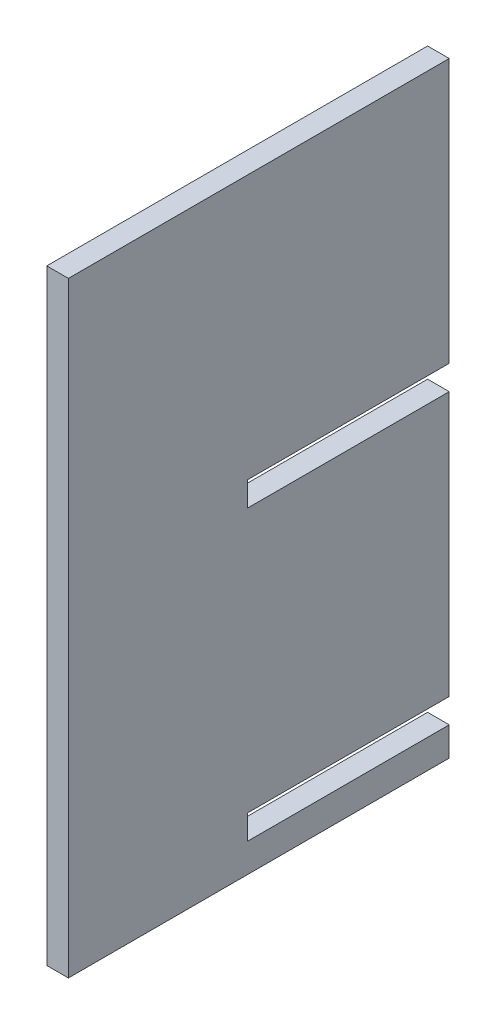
ISO-10303-21;
HEADER;
FILE_DESCRIPTION(('STEP AP214'),'2;1');
FILE_NAME('part.step','',(''),(''),'','','');
FILE_SCHEMA(('AUTOMOTIVE_DESIGN { 1 0 10303 214 1 1 1 1 }'));
ENDSEC;
DATA;
#1=APPLICATION_CONTEXT('core data for automotive mechanical design processes');
#2=APPLICATION_PROTOCOL_DEFINITION('international standard','automotive_design',2000,#1);
#3=PRODUCT_CONTEXT('',#1,'mechanical');
#4=PRODUCT('Part','Part','',(#3));
#5=PRODUCT_RELATED_PRODUCT_CATEGORY('part','',(#4));
#6=PRODUCT_DEFINITION_FORMATION('','',#4);
#7=PRODUCT_DEFINITION_CONTEXT('part definition',#1,'design');
#8=PRODUCT_DEFINITION('design','',#6,#7);
#9=PRODUCT_DEFINITION_SHAPE('','',#8);
#10=(LENGTH_UNIT() NAMED_UNIT(*) SI_UNIT(.MILLI.,.METRE.));
#11=(NAMED_UNIT(*) PLANE_ANGLE_UNIT() SI_UNIT($,.RADIAN.));
#12=(NAMED_UNIT(*) SI_UNIT($,.STERADIAN.) SOLID_ANGLE_UNIT());
#13=UNCERTAINTY_MEASURE_WITH_UNIT(LENGTH_MEASURE(1.E-05),#10,'distance_accuracy_value','');
#14=(GEOMETRIC_REPRESENTATION_CONTEXT(3) GLOBAL_UNCERTAINTY_ASSIGNED_CONTEXT((#13)) GLOBAL_UNIT_ASSIGNED_CONTEXT((#10,
#11,#12)) REPRESENTATION_CONTEXT('',''));
#15=CARTESIAN_POINT('',(0.,0.,0.));
#16=DIRECTION('',(0.,0.,1.));
#17=DIRECTION('',(1.,0.,0.));
#18=AXIS2_PLACEMENT_3D('',#15,#16,#17);
#19=CARTESIAN_POINT('',(0.,0.,0.));
#20=DIRECTION('',(0.,0.,-1.));
#21=DIRECTION('',(-1.,0.,0.));
#22=AXIS2_PLACEMENT_3D('',#19,#20,#21);
#23=PLANE('',#22);
#24=DIRECTION('',(1.,0.,0.));
#25=VECTOR('',#24,1.);
#26=CARTESIAN_POINT('',(-32.352836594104,19.15,0.));
#27=LINE('',#26,#25);
#28=CARTESIAN_POINT('',(-18.25,19.15,0.));
#29=VERTEX_POINT('',#28);
#30=CARTESIAN_POINT('',(-16.75,19.15,0.));
#31=VERTEX_POINT('',#30);
#32=EDGE_CURVE('E135',#29,#31,#27,.T.);
#33=ORIENTED_EDGE('',*,*,#32,.T.);
#34=DIRECTION('',(0.,1.,0.));
#35=VECTOR('',#34,1.);
#36=CARTESIAN_POINT('',(-16.75,-39.75,0.));
#37=LINE('',#36,#35);
#38=CARTESIAN_POINT('',(-16.75,0.849999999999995,0.));
#39=VERTEX_POINT('',#38);
#40=EDGE_CURVE('E132',#39,#31,#37,.T.);
#41=ORIENTED_EDGE('',*,*,#40,.F.);
#42=DIRECTION('',(1.,0.,0.));
#43=VECTOR('',#42,1.);
#44=CARTESIAN_POINT('',(-32.352836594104,0.849999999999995,0.));
#45=LINE('',#44,#43);
#46=CARTESIAN_POINT('',(-18.25,0.849999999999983,0.));
#47=VERTEX_POINT('',#46);
#48=EDGE_CURVE('E170',#47,#39,#45,.T.);
#49=ORIENTED_EDGE('',*,*,#48,.F.);
#50=DIRECTION('',(0.,-1.,0.));
#51=VECTOR('',#50,1.);
#52=CARTESIAN_POINT('',(-18.25,-39.75,0.));
#53=LINE('',#52,#51);
#54=EDGE_CURVE('E58',#29,#47,#53,.T.);
#55=ORIENTED_EDGE('',*,*,#54,.F.);
#56=EDGE_LOOP('',(#33,#41,#49,#55));
#57=FACE_BOUND('',#56,.T.);
#58=ADVANCED_FACE('F33',(#57),#23,.T.);
#59=DIRECTION('',(1.,0.,0.));
#60=VECTOR('',#59,1.);
#61=CARTESIAN_POINT('',(-32.352836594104,-0.850000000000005,0.));
#62=LINE('',#61,#60);
#63=CARTESIAN_POINT('',(-18.25,-0.850000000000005,0.));
#64=VERTEX_POINT('',#63);
#65=CARTESIAN_POINT('',(-16.75,-0.850000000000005,0.));
#66=VERTEX_POINT('',#65);
#67=EDGE_CURVE('E160',#64,#66,#62,.T.);
#68=ORIENTED_EDGE('',*,*,#67,.T.);
#69=CARTESIAN_POINT('',(-16.75,-19.15,0.));
#70=VERTEX_POINT('',#69);
#71=EDGE_CURVE('E206',#70,#66,#37,.T.);
#72=ORIENTED_EDGE('',*,*,#71,.F.);
#73=DIRECTION('',(1.,0.,0.));
#74=VECTOR('',#73,1.);
#75=CARTESIAN_POINT('',(-32.352836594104,-19.15,0.));
#76=LINE('',#75,#74);
#77=CARTESIAN_POINT('',(-18.25,-19.15,0.));
#78=VERTEX_POINT('',#77);
#79=EDGE_CURVE('E194',#78,#70,#76,.T.);
#80=ORIENTED_EDGE('',*,*,#79,.F.);
#81=EDGE_CURVE('E205',#64,#78,#53,.T.);
#82=ORIENTED_EDGE('',*,*,#81,.F.);
#83=EDGE_LOOP('',(#68,#72,#80,#82));
#84=FACE_BOUND('',#83,.T.);
#85=ADVANCED_FACE('F231',(#84),#23,.T.);
#86=DIRECTION('',(1.,0.,0.));
#87=VECTOR('',#86,1.);
#88=CARTESIAN_POINT('',(-51.7361165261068,-22.85,0.));
#89=LINE('',#88,#87);
#90=CARTESIAN_POINT('',(-18.25,-22.85,0.));
#91=VERTEX_POINT('',#90);
#92=CARTESIAN_POINT('',(-16.75,-22.85,0.));
#93=VERTEX_POINT('',#92);
#94=EDGE_CURVE('E148',#91,#93,#89,.T.);
#95=ORIENTED_EDGE('',*,*,#94,.F.);
#96=CARTESIAN_POINT('',(-18.25,-20.85,0.));
#97=VERTEX_POINT('',#96);
#98=EDGE_CURVE('E204',#97,#91,#53,.T.);
#99=ORIENTED_EDGE('',*,*,#98,.F.);
#100=DIRECTION('',(1.,0.,0.));
#101=VECTOR('',#100,1.);
#102=CARTESIAN_POINT('',(-32.352836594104,-20.85,0.));
#103=LINE('',#102,#101);
#104=CARTESIAN_POINT('',(-16.75,-20.85,0.));
#105=VERTEX_POINT('',#104);
#106=EDGE_CURVE('E183',#97,#105,#103,.T.);
#107=ORIENTED_EDGE('',*,*,#106,.T.);
#108=EDGE_CURVE('E37',#93,#105,#37,.T.);
#109=ORIENTED_EDGE('',*,*,#108,.F.);
#110=EDGE_LOOP('',(#95,#99,#107,#109));
#111=FACE_BOUND('',#110,.T.);
#112=ADVANCED_FACE('F213',(#111),#23,.T.);
#113=CARTESIAN_POINT('',(-18.25,-39.75,26.4));
#114=DIRECTION('',(1.,0.,0.));
#115=DIRECTION('',(0.,0.,-1.));
#116=AXIS2_PLACEMENT_3D('',#113,#114,#115);
#117=PLANE('',#116);
#118=DIRECTION('',(0.,-1.,0.));
#119=VECTOR('',#118,1.);
#120=CARTESIAN_POINT('',(-18.25,-39.75,26.4));
#121=LINE('',#120,#119);
#122=CARTESIAN_POINT('',(-18.25,19.15,26.4));
#123=VERTEX_POINT('',#122);
#124=CARTESIAN_POINT('',(-18.25,-22.85,26.4));
#125=VERTEX_POINT('',#124);
#126=EDGE_CURVE('E42',#123,#125,#121,.T.);
#127=ORIENTED_EDGE('',*,*,#126,.F.);
#128=DIRECTION('',(0.,0.,1.));
#129=VECTOR('',#128,1.);
#130=CARTESIAN_POINT('',(-18.25,19.15,0.));
#131=LINE('',#130,#129);
#132=EDGE_CURVE('E141',#29,#123,#131,.T.);
#133=ORIENTED_EDGE('',*,*,#132,.F.);
#134=ORIENTED_EDGE('',*,*,#54,.T.);
#135=DIRECTION('',(0.,0.,-1.));
#136=VECTOR('',#135,1.);
#137=CARTESIAN_POINT('',(-18.25,0.849999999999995,0.));
#138=LINE('',#137,#136);
#139=CARTESIAN_POINT('',(-18.25,0.849999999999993,14.));
#140=VERTEX_POINT('',#139);
#141=EDGE_CURVE('E162',#140,#47,#138,.T.);
#142=ORIENTED_EDGE('',*,*,#141,.F.);
#143=DIRECTION('',(0.,1.,0.));
#144=VECTOR('',#143,1.);
#145=CARTESIAN_POINT('',(-18.25,-0.850000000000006,14.));
#146=LINE('',#145,#144);
#147=CARTESIAN_POINT('',(-18.25,-0.850000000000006,14.));
#148=VERTEX_POINT('',#147);
#149=EDGE_CURVE('E157',#148,#140,#146,.T.);
#150=ORIENTED_EDGE('',*,*,#149,.F.);
#151=DIRECTION('',(0.,0.,1.));
#152=VECTOR('',#151,1.);
#153=CARTESIAN_POINT('',(-18.25,-0.850000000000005,0.));
#154=LINE('',#153,#152);
#155=EDGE_CURVE('E159',#64,#148,#154,.T.);
#156=ORIENTED_EDGE('',*,*,#155,.F.);
#157=ORIENTED_EDGE('',*,*,#81,.T.);
#158=DIRECTION('',(0.,0.,-1.));
#159=VECTOR('',#158,1.);
#160=CARTESIAN_POINT('',(-18.25,-19.15,0.));
#161=LINE('',#160,#159);
#162=CARTESIAN_POINT('',(-18.25,-19.15,14.));
#163=VERTEX_POINT('',#162);
#164=EDGE_CURVE('E185',#163,#78,#161,.T.);
#165=ORIENTED_EDGE('',*,*,#164,.F.);
#166=DIRECTION('',(0.,1.,0.));
#167=VECTOR('',#166,1.);
#168=CARTESIAN_POINT('',(-18.25,-20.85,14.));
#169=LINE('',#168,#167);
#170=CARTESIAN_POINT('',(-18.25,-20.85,14.));
#171=VERTEX_POINT('',#170);
#172=EDGE_CURVE('E180',#171,#163,#169,.T.);
#173=ORIENTED_EDGE('',*,*,#172,.F.);
#174=DIRECTION('',(0.,0.,1.));
#175=VECTOR('',#174,1.);
#176=CARTESIAN_POINT('',(-18.25,-20.85,0.));
#177=LINE('',#176,#175);
#178=EDGE_CURVE('E182',#97,#171,#177,.T.);
#179=ORIENTED_EDGE('',*,*,#178,.F.);
#180=ORIENTED_EDGE('',*,*,#98,.T.);
#181=DIRECTION('',(0.,0.,-1.));
#182=VECTOR('',#181,1.);
#183=CARTESIAN_POINT('',(-18.25,-22.85,0.));
#184=LINE('',#183,#182);
#185=EDGE_CURVE('E136',#125,#91,#184,.T.);
#186=ORIENTED_EDGE('',*,*,#185,.F.);
#187=EDGE_LOOP('',(#127,#133,#134,#142,#150,#156,#157,#165,#173,#179,#180,#186));
#188=FACE_BOUND('',#187,.T.);
#189=ADVANCED_FACE('F35',(#188),#117,.F.);
#190=CARTESIAN_POINT('',(-16.75,-39.75,26.4));
#191=DIRECTION('',(-1.,0.,0.));
#192=DIRECTION('',(0.,0.,1.));
#193=AXIS2_PLACEMENT_3D('',#190,#191,#192);
#194=PLANE('',#193);
#195=DIRECTION('',(0.,0.,-1.));
#196=VECTOR('',#195,1.);
#197=CARTESIAN_POINT('',(-16.75,19.15,0.));
#198=LINE('',#197,#196);
#199=CARTESIAN_POINT('',(-16.75,19.15,26.4));
#200=VERTEX_POINT('',#199);
#201=EDGE_CURVE('E127',#200,#31,#198,.T.);
#202=ORIENTED_EDGE('',*,*,#201,.F.);
#203=DIRECTION('',(0.,1.,0.));
#204=VECTOR('',#203,1.);
#205=CARTESIAN_POINT('',(-16.75,-39.75,26.4));
#206=LINE('',#205,#204);
#207=CARTESIAN_POINT('',(-16.75,-22.85,26.4));
#208=VERTEX_POINT('',#207);
#209=EDGE_CURVE('E11',#208,#200,#206,.T.);
#210=ORIENTED_EDGE('',*,*,#209,.F.);
#211=DIRECTION('',(0.,0.,1.));
#212=VECTOR('',#211,1.);
#213=CARTESIAN_POINT('',(-16.75,-22.85,0.));
#214=LINE('',#213,#212);
#215=EDGE_CURVE('E50',#93,#208,#214,.T.);
#216=ORIENTED_EDGE('',*,*,#215,.F.);
#217=ORIENTED_EDGE('',*,*,#108,.T.);
#218=DIRECTION('',(0.,0.,-1.));
#219=VECTOR('',#218,1.);
#220=CARTESIAN_POINT('',(-16.75,-20.85,0.));
#221=LINE('',#220,#219);
#222=CARTESIAN_POINT('',(-16.75,-20.85,14.));
#223=VERTEX_POINT('',#222);
#224=EDGE_CURVE('E191',#223,#105,#221,.T.);
#225=ORIENTED_EDGE('',*,*,#224,.F.);
#226=DIRECTION('',(0.,-1.,0.));
#227=VECTOR('',#226,1.);
#228=CARTESIAN_POINT('',(-16.75,-20.85,14.));
#229=LINE('',#228,#227);
#230=CARTESIAN_POINT('',(-16.75,-19.15,14.));
#231=VERTEX_POINT('',#230);
#232=EDGE_CURVE('E188',#231,#223,#229,.T.);
#233=ORIENTED_EDGE('',*,*,#232,.F.);
#234=DIRECTION('',(0.,0.,1.));
#235=VECTOR('',#234,1.);
#236=CARTESIAN_POINT('',(-16.75,-19.15,0.));
#237=LINE('',#236,#235);
#238=EDGE_CURVE('E179',#70,#231,#237,.T.);
#239=ORIENTED_EDGE('',*,*,#238,.F.);
#240=ORIENTED_EDGE('',*,*,#71,.T.);
#241=DIRECTION('',(0.,0.,-1.));
#242=VECTOR('',#241,1.);
#243=CARTESIAN_POINT('',(-16.75,-0.850000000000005,0.));
#244=LINE('',#243,#242);
#245=CARTESIAN_POINT('',(-16.75,-0.850000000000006,14.));
#246=VERTEX_POINT('',#245);
#247=EDGE_CURVE('E168',#246,#66,#244,.T.);
#248=ORIENTED_EDGE('',*,*,#247,.F.);
#249=DIRECTION('',(0.,-1.,0.));
#250=VECTOR('',#249,1.);
#251=CARTESIAN_POINT('',(-16.75,-0.850000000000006,14.));
#252=LINE('',#251,#250);
#253=CARTESIAN_POINT('',(-16.75,0.849999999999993,14.));
#254=VERTEX_POINT('',#253);
#255=EDGE_CURVE('E165',#254,#246,#252,.T.);
#256=ORIENTED_EDGE('',*,*,#255,.F.);
#257=DIRECTION('',(0.,0.,1.));
#258=VECTOR('',#257,1.);
#259=CARTESIAN_POINT('',(-16.75,0.849999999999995,0.));
#260=LINE('',#259,#258);
#261=EDGE_CURVE('E154',#39,#254,#260,.T.);
#262=ORIENTED_EDGE('',*,*,#261,.F.);
#263=ORIENTED_EDGE('',*,*,#40,.T.);
#264=EDGE_LOOP('',(#202,#210,#216,#217,#225,#233,#239,#240,#248,#256,#262,#263));
#265=FACE_BOUND('',#264,.T.);
#266=ADVANCED_FACE('F129',(#265),#194,.F.);
#267=CARTESIAN_POINT('',(0.,0.,26.4));
#268=DIRECTION('',(0.,0.,-1.));
#269=DIRECTION('',(-1.,0.,0.));
#270=AXIS2_PLACEMENT_3D('',#267,#268,#269);
#271=PLANE('',#270);
#272=ORIENTED_EDGE('',*,*,#209,.T.);
#273=DIRECTION('',(1.,0.,0.));
#274=VECTOR('',#273,1.);
#275=CARTESIAN_POINT('',(-51.7361165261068,19.15,26.4));
#276=LINE('',#275,#274);
#277=EDGE_CURVE('E139',#123,#200,#276,.T.);
#278=ORIENTED_EDGE('',*,*,#277,.F.);
#279=ORIENTED_EDGE('',*,*,#126,.T.);
#280=DIRECTION('',(1.,0.,0.));
#281=VECTOR('',#280,1.);
#282=CARTESIAN_POINT('',(-51.7361165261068,-22.85,26.4));
#283=LINE('',#282,#281);
#284=EDGE_CURVE('E146',#125,#208,#283,.T.);
#285=ORIENTED_EDGE('',*,*,#284,.T.);
#286=EDGE_LOOP('',(#272,#278,#279,#285));
#287=FACE_BOUND('',#286,.T.);
#288=ADVANCED_FACE('F145',(#287),#271,.F.);
#289=CARTESIAN_POINT('',(-32.352836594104,-20.85,0.));
#290=DIRECTION('',(0.,-1.,0.));
#291=DIRECTION('',(0.,0.,-1.));
#292=AXIS2_PLACEMENT_3D('',#289,#290,#291);
#293=PLANE('',#292);
#294=ORIENTED_EDGE('',*,*,#178,.T.);
#295=DIRECTION('',(1.,0.,0.));
#296=VECTOR('',#295,1.);
#297=CARTESIAN_POINT('',(-32.352836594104,-20.85,14.));
#298=LINE('',#297,#296);
#299=EDGE_CURVE('E197',#171,#223,#298,.T.);
#300=ORIENTED_EDGE('',*,*,#299,.T.);
#301=ORIENTED_EDGE('',*,*,#224,.T.);
#302=ORIENTED_EDGE('',*,*,#106,.F.);
#303=EDGE_LOOP('',(#294,#300,#301,#302));
#304=FACE_BOUND('',#303,.T.);
#305=ADVANCED_FACE('F219',(#304),#293,.F.);
#306=CARTESIAN_POINT('',(-32.352836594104,-20.85,14.));
#307=DIRECTION('',(0.,0.,1.));
#308=DIRECTION('',(1.,0.,0.));
#309=AXIS2_PLACEMENT_3D('',#306,#307,#308);
#310=PLANE('',#309);
#311=ORIENTED_EDGE('',*,*,#172,.T.);
#312=DIRECTION('',(1.,0.,0.));
#313=VECTOR('',#312,1.);
#314=CARTESIAN_POINT('',(-32.352836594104,-19.15,14.));
#315=LINE('',#314,#313);
#316=EDGE_CURVE('E199',#163,#231,#315,.T.);
#317=ORIENTED_EDGE('',*,*,#316,.T.);
#318=ORIENTED_EDGE('',*,*,#232,.T.);
#319=ORIENTED_EDGE('',*,*,#299,.F.);
#320=EDGE_LOOP('',(#311,#317,#318,#319));
#321=FACE_BOUND('',#320,.T.);
#322=ADVANCED_FACE('F222',(#321),#310,.F.);
#323=CARTESIAN_POINT('',(-32.352836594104,-19.15,0.));
#324=DIRECTION('',(0.,1.,0.));
#325=DIRECTION('',(0.,0.,1.));
#326=AXIS2_PLACEMENT_3D('',#323,#324,#325);
#327=PLANE('',#326);
#328=ORIENTED_EDGE('',*,*,#164,.T.);
#329=ORIENTED_EDGE('',*,*,#79,.T.);
#330=ORIENTED_EDGE('',*,*,#238,.T.);
#331=ORIENTED_EDGE('',*,*,#316,.F.);
#332=EDGE_LOOP('',(#328,#329,#330,#331));
#333=FACE_BOUND('',#332,.T.);
#334=ADVANCED_FACE('F268',(#333),#327,.F.);
#335=CARTESIAN_POINT('',(-32.352836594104,-0.850000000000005,0.));
#336=DIRECTION('',(0.,-1.,0.));
#337=DIRECTION('',(0.,0.,-1.));
#338=AXIS2_PLACEMENT_3D('',#335,#336,#337);
#339=PLANE('',#338);
#340=ORIENTED_EDGE('',*,*,#155,.T.);
#341=DIRECTION('',(1.,0.,0.));
#342=VECTOR('',#341,1.);
#343=CARTESIAN_POINT('',(-32.352836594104,-0.850000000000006,14.));
#344=LINE('',#343,#342);
#345=EDGE_CURVE('E173',#148,#246,#344,.T.);
#346=ORIENTED_EDGE('',*,*,#345,.T.);
#347=ORIENTED_EDGE('',*,*,#247,.T.);
#348=ORIENTED_EDGE('',*,*,#67,.F.);
#349=EDGE_LOOP('',(#340,#346,#347,#348));
#350=FACE_BOUND('',#349,.T.);
#351=ADVANCED_FACE('F235',(#350),#339,.F.);
#352=CARTESIAN_POINT('',(-32.352836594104,-0.850000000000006,14.));
#353=DIRECTION('',(0.,0.,1.));
#354=DIRECTION('',(1.,0.,0.));
#355=AXIS2_PLACEMENT_3D('',#352,#353,#354);
#356=PLANE('',#355);
#357=ORIENTED_EDGE('',*,*,#149,.T.);
#358=DIRECTION('',(1.,0.,0.));
#359=VECTOR('',#358,1.);
#360=CARTESIAN_POINT('',(-32.352836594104,0.849999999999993,14.));
#361=LINE('',#360,#359);
#362=EDGE_CURVE('E175',#140,#254,#361,.T.);
#363=ORIENTED_EDGE('',*,*,#362,.T.);
#364=ORIENTED_EDGE('',*,*,#255,.T.);
#365=ORIENTED_EDGE('',*,*,#345,.F.);
#366=EDGE_LOOP('',(#357,#363,#364,#365));
#367=FACE_BOUND('',#366,.T.);
#368=ADVANCED_FACE('F241',(#367),#356,.F.);
#369=CARTESIAN_POINT('',(-32.352836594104,0.849999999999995,0.));
#370=DIRECTION('',(0.,1.,0.));
#371=DIRECTION('',(0.,0.,1.));
#372=AXIS2_PLACEMENT_3D('',#369,#370,#371);
#373=PLANE('',#372);
#374=ORIENTED_EDGE('',*,*,#141,.T.);
#375=ORIENTED_EDGE('',*,*,#48,.T.);
#376=ORIENTED_EDGE('',*,*,#261,.T.);
#377=ORIENTED_EDGE('',*,*,#362,.F.);
#378=EDGE_LOOP('',(#374,#375,#376,#377));
#379=FACE_BOUND('',#378,.T.);
#380=ADVANCED_FACE('F243',(#379),#373,.F.);
#381=CARTESIAN_POINT('',(-32.352836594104,19.15,0.));
#382=DIRECTION('',(0.,-1.,0.));
#383=DIRECTION('',(0.,0.,-1.));
#384=AXIS2_PLACEMENT_3D('',#381,#382,#383);
#385=PLANE('',#384);
#386=ORIENTED_EDGE('',*,*,#132,.T.);
#387=ORIENTED_EDGE('',*,*,#277,.T.);
#388=ORIENTED_EDGE('',*,*,#201,.T.);
#389=ORIENTED_EDGE('',*,*,#32,.F.);
#390=EDGE_LOOP('',(#386,#387,#388,#389));
#391=FACE_BOUND('',#390,.T.);
#392=ADVANCED_FACE('F140',(#391),#385,.F.);
#393=CARTESIAN_POINT('',(-51.7361165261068,-22.85,0.));
#394=DIRECTION('',(0.,1.,0.));
#395=DIRECTION('',(0.,0.,1.));
#396=AXIS2_PLACEMENT_3D('',#393,#394,#395);
#397=PLANE('',#396);
#398=ORIENTED_EDGE('',*,*,#185,.T.);
#399=ORIENTED_EDGE('',*,*,#94,.T.);
#400=ORIENTED_EDGE('',*,*,#215,.T.);
#401=ORIENTED_EDGE('',*,*,#284,.F.);
#402=EDGE_LOOP('',(#398,#399,#400,#401));
#403=FACE_BOUND('',#402,.T.);
#404=ADVANCED_FACE('F215',(#403),#397,.F.);
#405=CLOSED_SHELL('',(#58,#85,#112,#189,#266,#288,#305,#322,#334,#351,#368,#380,#392,#404));
#406=MANIFOLD_SOLID_BREP('B2',#405);
#407=ADVANCED_BREP_SHAPE_REPRESENTATION('',(#18,#406),#14);
#408=SHAPE_DEFINITION_REPRESENTATION(#9,#407);
ENDSEC;
END-ISO-10303-21;
